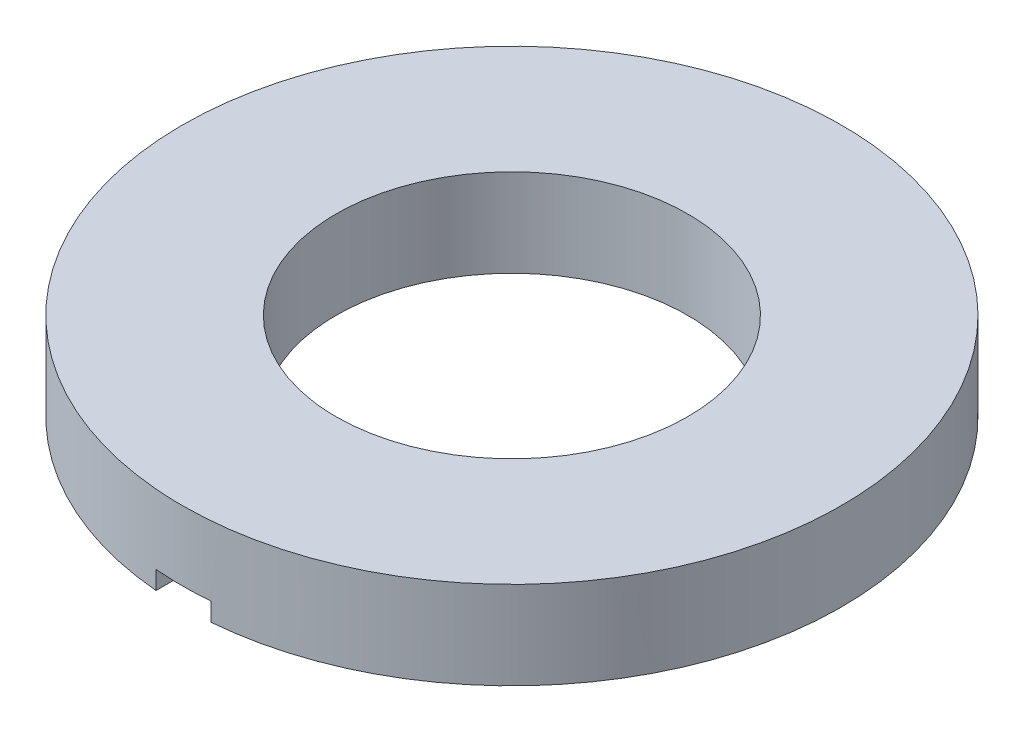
ISO-10303-21;
HEADER;
FILE_DESCRIPTION(('STEP AP214'),'2;1');
FILE_NAME('part.step','',(''),(''),'','','');
FILE_SCHEMA(('AUTOMOTIVE_DESIGN { 1 0 10303 214 1 1 1 1 }'));
ENDSEC;
DATA;
#1=APPLICATION_CONTEXT('core data for automotive mechanical design processes');
#2=APPLICATION_PROTOCOL_DEFINITION('international standard','automotive_design',2000,#1);
#3=PRODUCT_CONTEXT('',#1,'mechanical');
#4=PRODUCT('Part','Part','',(#3));
#5=PRODUCT_RELATED_PRODUCT_CATEGORY('part','',(#4));
#6=PRODUCT_DEFINITION_FORMATION('','',#4);
#7=PRODUCT_DEFINITION_CONTEXT('part definition',#1,'design');
#8=PRODUCT_DEFINITION('design','',#6,#7);
#9=PRODUCT_DEFINITION_SHAPE('','',#8);
#10=(LENGTH_UNIT() NAMED_UNIT(*) SI_UNIT(.MILLI.,.METRE.));
#11=(NAMED_UNIT(*) PLANE_ANGLE_UNIT() SI_UNIT($,.RADIAN.));
#12=(NAMED_UNIT(*) SI_UNIT($,.STERADIAN.) SOLID_ANGLE_UNIT());
#13=UNCERTAINTY_MEASURE_WITH_UNIT(LENGTH_MEASURE(1.E-05),#10,'distance_accuracy_value','');
#14=(GEOMETRIC_REPRESENTATION_CONTEXT(3) GLOBAL_UNCERTAINTY_ASSIGNED_CONTEXT((#13)) GLOBAL_UNIT_ASSIGNED_CONTEXT((#10,
#11,#12)) REPRESENTATION_CONTEXT('',''));
#15=CARTESIAN_POINT('',(0.,0.,0.));
#16=DIRECTION('',(0.,0.,1.));
#17=DIRECTION('',(1.,0.,0.));
#18=AXIS2_PLACEMENT_3D('',#15,#16,#17);
#19=CARTESIAN_POINT('',(0.,1.6,0.));
#20=DIRECTION('',(0.,1.,0.));
#21=DIRECTION('',(0.,0.,1.));
#22=AXIS2_PLACEMENT_3D('',#19,#20,#21);
#23=PLANE('',#22);
#24=CARTESIAN_POINT('',(0.,1.6,0.));
#25=DIRECTION('',(0.,1.,0.));
#26=DIRECTION('',(0.,0.,1.));
#27=AXIS2_PLACEMENT_3D('',#24,#25,#26);
#28=CIRCLE('',#27,6.);
#29=CARTESIAN_POINT('',(0.,1.6,6.));
#30=VERTEX_POINT('',#29);
#31=EDGE_CURVE('E114',#30,#30,#28,.T.);
#32=ORIENTED_EDGE('',*,*,#31,.T.);
#33=EDGE_LOOP('',(#32));
#34=FACE_BOUND('',#33,.T.);
#35=CARTESIAN_POINT('',(0.,1.6,0.));
#36=DIRECTION('',(0.,1.,0.));
#37=DIRECTION('',(0.,0.,1.));
#38=AXIS2_PLACEMENT_3D('',#35,#36,#37);
#39=CIRCLE('',#38,3.2);
#40=CARTESIAN_POINT('',(0.,1.6,3.2));
#41=VERTEX_POINT('',#40);
#42=EDGE_CURVE('E102',#41,#41,#39,.T.);
#43=ORIENTED_EDGE('',*,*,#42,.F.);
#44=EDGE_LOOP('',(#43));
#45=FACE_BOUND('',#44,.T.);
#46=ADVANCED_FACE('F39',(#34,#45),#23,.T.);
#47=CARTESIAN_POINT('',(0.,0.,0.));
#48=DIRECTION('',(0.,1.,0.));
#49=DIRECTION('',(0.,0.,1.));
#50=AXIS2_PLACEMENT_3D('',#47,#48,#49);
#51=PLANE('',#50);
#52=CARTESIAN_POINT('',(0.,0.,0.));
#53=DIRECTION('',(0.,1.,0.));
#54=DIRECTION('',(0.,0.,1.));
#55=AXIS2_PLACEMENT_3D('',#52,#53,#54);
#56=CIRCLE('',#55,6.);
#57=CARTESIAN_POINT('',(0.5,0.,5.9791303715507));
#58=VERTEX_POINT('',#57);
#59=CARTESIAN_POINT('',(-0.5,0.,5.9791303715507));
#60=VERTEX_POINT('',#59);
#61=EDGE_CURVE('E94',#58,#60,#56,.T.);
#62=ORIENTED_EDGE('',*,*,#61,.F.);
#63=DIRECTION('',(0.,0.,1.));
#64=VECTOR('',#63,1.);
#65=CARTESIAN_POINT('',(0.5,0.,0.399999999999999));
#66=LINE('',#65,#64);
#67=CARTESIAN_POINT('',(0.5,0.,3.16069612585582));
#68=VERTEX_POINT('',#67);
#69=EDGE_CURVE('E81',#68,#58,#66,.T.);
#70=ORIENTED_EDGE('',*,*,#69,.F.);
#71=CARTESIAN_POINT('',(0.,0.,0.));
#72=DIRECTION('',(0.,1.,0.));
#73=DIRECTION('',(0.,0.,1.));
#74=AXIS2_PLACEMENT_3D('',#71,#72,#73);
#75=CIRCLE('',#74,3.2);
#76=CARTESIAN_POINT('',(-0.5,0.,3.16069612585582));
#77=VERTEX_POINT('',#76);
#78=EDGE_CURVE('E92',#68,#77,#75,.T.);
#79=ORIENTED_EDGE('',*,*,#78,.T.);
#80=DIRECTION('',(0.,0.,-1.));
#81=VECTOR('',#80,1.);
#82=CARTESIAN_POINT('',(-0.5,0.,0.399999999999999));
#83=LINE('',#82,#81);
#84=EDGE_CURVE('E96',#60,#77,#83,.T.);
#85=ORIENTED_EDGE('',*,*,#84,.F.);
#86=EDGE_LOOP('',(#62,#70,#79,#85));
#87=FACE_BOUND('',#86,.T.);
#88=ADVANCED_FACE('F90',(#87),#51,.F.);
#89=CARTESIAN_POINT('',(0.,1.6,0.));
#90=DIRECTION('',(0.,-1.,0.));
#91=DIRECTION('',(0.,0.,-1.));
#92=AXIS2_PLACEMENT_3D('',#89,#90,#91);
#93=CYLINDRICAL_SURFACE('',#92,6.);
#94=ORIENTED_EDGE('',*,*,#31,.F.);
#95=EDGE_LOOP('',(#94));
#96=FACE_BOUND('',#95,.T.);
#97=CARTESIAN_POINT('',(0.,0.333333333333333,0.));
#98=DIRECTION('',(0.,1.,0.));
#99=DIRECTION('',(0.,0.,1.));
#100=AXIS2_PLACEMENT_3D('',#97,#98,#99);
#101=CIRCLE('',#100,6.);
#102=CARTESIAN_POINT('',(-0.5,0.333333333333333,5.9791303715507));
#103=VERTEX_POINT('',#102);
#104=CARTESIAN_POINT('',(0.5,0.333333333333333,5.9791303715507));
#105=VERTEX_POINT('',#104);
#106=EDGE_CURVE('E60',#103,#105,#101,.T.);
#107=ORIENTED_EDGE('',*,*,#106,.T.);
#108=DIRECTION('',(0.,-1.,0.));
#109=VECTOR('',#108,1.);
#110=CARTESIAN_POINT('',(0.5,1.6,5.9791303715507));
#111=LINE('',#110,#109);
#112=EDGE_CURVE('E103',#105,#58,#111,.T.);
#113=ORIENTED_EDGE('',*,*,#112,.T.);
#114=ORIENTED_EDGE('',*,*,#61,.T.);
#115=DIRECTION('',(0.,-1.,0.));
#116=VECTOR('',#115,1.);
#117=CARTESIAN_POINT('',(-0.5,1.6,5.9791303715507));
#118=LINE('',#117,#116);
#119=EDGE_CURVE('E111',#60,#103,#118,.F.);
#120=ORIENTED_EDGE('',*,*,#119,.T.);
#121=EDGE_LOOP('',(#107,#113,#114,#120));
#122=FACE_BOUND('',#121,.T.);
#123=ADVANCED_FACE('F41',(#96,#122),#93,.T.);
#124=CARTESIAN_POINT('',(0.,1.6,0.));
#125=DIRECTION('',(0.,-1.,0.));
#126=DIRECTION('',(0.,0.,-1.));
#127=AXIS2_PLACEMENT_3D('',#124,#125,#126);
#128=CYLINDRICAL_SURFACE('',#127,3.2);
#129=DIRECTION('',(0.,-1.,0.));
#130=VECTOR('',#129,1.);
#131=CARTESIAN_POINT('',(0.5,1.6,3.16069612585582));
#132=LINE('',#131,#130);
#133=CARTESIAN_POINT('',(0.5,0.333333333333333,3.16069612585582));
#134=VERTEX_POINT('',#133);
#135=EDGE_CURVE('E11',#134,#68,#132,.T.);
#136=ORIENTED_EDGE('',*,*,#135,.F.);
#137=CARTESIAN_POINT('',(0.,0.333333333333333,0.));
#138=DIRECTION('',(0.,1.,0.));
#139=DIRECTION('',(0.,0.,1.));
#140=AXIS2_PLACEMENT_3D('',#137,#138,#139);
#141=CIRCLE('',#140,3.2);
#142=CARTESIAN_POINT('',(-0.5,0.333333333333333,3.16069612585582));
#143=VERTEX_POINT('',#142);
#144=EDGE_CURVE('E118',#143,#134,#141,.T.);
#145=ORIENTED_EDGE('',*,*,#144,.F.);
#146=DIRECTION('',(0.,-1.,0.));
#147=VECTOR('',#146,1.);
#148=CARTESIAN_POINT('',(-0.5,1.6,3.16069612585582));
#149=LINE('',#148,#147);
#150=EDGE_CURVE('E48',#77,#143,#149,.F.);
#151=ORIENTED_EDGE('',*,*,#150,.F.);
#152=ORIENTED_EDGE('',*,*,#78,.F.);
#153=EDGE_LOOP('',(#136,#145,#151,#152));
#154=FACE_BOUND('',#153,.T.);
#155=ORIENTED_EDGE('',*,*,#42,.T.);
#156=EDGE_LOOP('',(#155));
#157=FACE_BOUND('',#156,.T.);
#158=ADVANCED_FACE('F99',(#154,#157),#128,.F.);
#159=CARTESIAN_POINT('',(0.5,0.333333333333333,0.399999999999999));
#160=DIRECTION('',(1.,0.,0.));
#161=DIRECTION('',(0.,0.,-1.));
#162=AXIS2_PLACEMENT_3D('',#159,#160,#161);
#163=PLANE('',#162);
#164=DIRECTION('',(0.,0.,1.));
#165=VECTOR('',#164,1.);
#166=CARTESIAN_POINT('',(0.5,0.333333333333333,0.399999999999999));
#167=LINE('',#166,#165);
#168=EDGE_CURVE('E83',#134,#105,#167,.T.);
#169=ORIENTED_EDGE('',*,*,#168,.F.);
#170=ORIENTED_EDGE('',*,*,#135,.T.);
#171=ORIENTED_EDGE('',*,*,#69,.T.);
#172=ORIENTED_EDGE('',*,*,#112,.F.);
#173=EDGE_LOOP('',(#169,#170,#171,#172));
#174=FACE_BOUND('',#173,.T.);
#175=ADVANCED_FACE('F79',(#174),#163,.F.);
#176=CARTESIAN_POINT('',(-0.5,0.333333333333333,0.399999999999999));
#177=DIRECTION('',(-1.,0.,0.));
#178=DIRECTION('',(0.,0.,1.));
#179=AXIS2_PLACEMENT_3D('',#176,#177,#178);
#180=PLANE('',#179);
#181=ORIENTED_EDGE('',*,*,#84,.T.);
#182=ORIENTED_EDGE('',*,*,#150,.T.);
#183=DIRECTION('',(0.,0.,-1.));
#184=VECTOR('',#183,1.);
#185=CARTESIAN_POINT('',(-0.5,0.333333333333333,0.399999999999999));
#186=LINE('',#185,#184);
#187=EDGE_CURVE('E55',#103,#143,#186,.T.);
#188=ORIENTED_EDGE('',*,*,#187,.F.);
#189=ORIENTED_EDGE('',*,*,#119,.F.);
#190=EDGE_LOOP('',(#181,#182,#188,#189));
#191=FACE_BOUND('',#190,.T.);
#192=ADVANCED_FACE('F124',(#191),#180,.F.);
#193=CARTESIAN_POINT('',(0.,0.333333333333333,0.));
#194=DIRECTION('',(0.,1.,0.));
#195=DIRECTION('',(0.,0.,1.));
#196=AXIS2_PLACEMENT_3D('',#193,#194,#195);
#197=PLANE('',#196);
#198=ORIENTED_EDGE('',*,*,#106,.F.);
#199=ORIENTED_EDGE('',*,*,#187,.T.);
#200=ORIENTED_EDGE('',*,*,#144,.T.);
#201=ORIENTED_EDGE('',*,*,#168,.T.);
#202=EDGE_LOOP('',(#198,#199,#200,#201));
#203=FACE_BOUND('',#202,.T.);
#204=ADVANCED_FACE('F126',(#203),#197,.F.);
#205=CLOSED_SHELL('',(#46,#88,#123,#158,#175,#192,#204));
#206=MANIFOLD_SOLID_BREP('B2',#205);
#207=ADVANCED_BREP_SHAPE_REPRESENTATION('',(#18,#206),#14);
#208=SHAPE_DEFINITION_REPRESENTATION(#9,#207);
ENDSEC;
END-ISO-10303-21;
